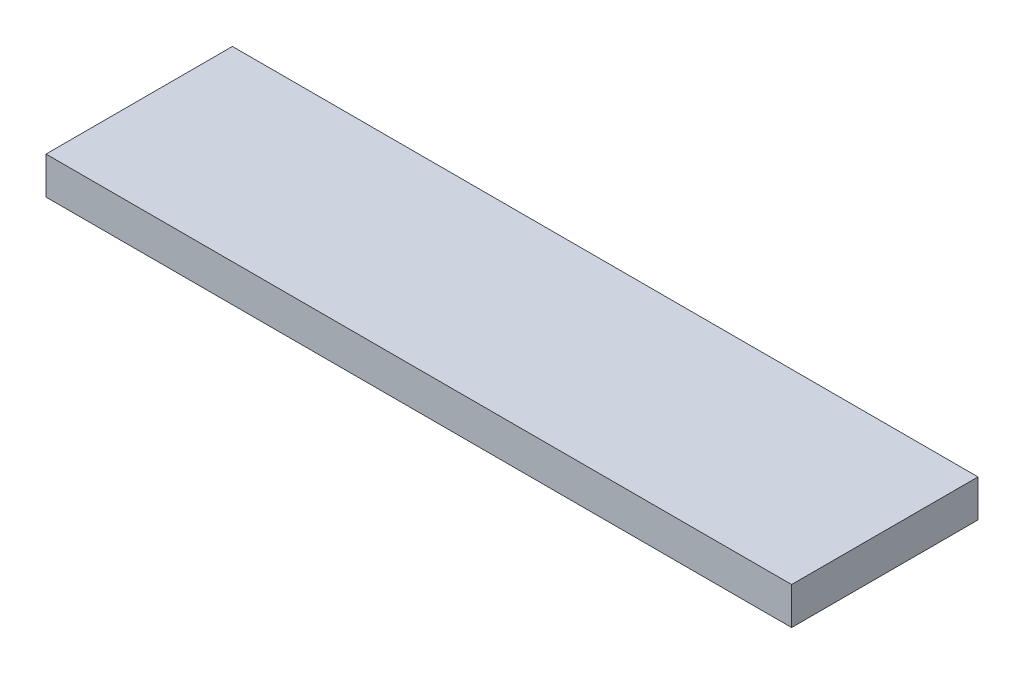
ISO-10303-21;
HEADER;
FILE_DESCRIPTION(('STEP AP214'),'2;1');
FILE_NAME('part.step','',(''),(''),'','','');
FILE_SCHEMA(('AUTOMOTIVE_DESIGN { 1 0 10303 214 1 1 1 1 }'));
ENDSEC;
DATA;
#1=APPLICATION_CONTEXT('core data for automotive mechanical design processes');
#2=APPLICATION_PROTOCOL_DEFINITION('international standard','automotive_design',2000,#1);
#3=PRODUCT_CONTEXT('',#1,'mechanical');
#4=PRODUCT('Part','Part','',(#3));
#5=PRODUCT_RELATED_PRODUCT_CATEGORY('part','',(#4));
#6=PRODUCT_DEFINITION_FORMATION('','',#4);
#7=PRODUCT_DEFINITION_CONTEXT('part definition',#1,'design');
#8=PRODUCT_DEFINITION('design','',#6,#7);
#9=PRODUCT_DEFINITION_SHAPE('','',#8);
#10=(LENGTH_UNIT() NAMED_UNIT(*) SI_UNIT(.MILLI.,.METRE.));
#11=(NAMED_UNIT(*) PLANE_ANGLE_UNIT() SI_UNIT($,.RADIAN.));
#12=(NAMED_UNIT(*) SI_UNIT($,.STERADIAN.) SOLID_ANGLE_UNIT());
#13=UNCERTAINTY_MEASURE_WITH_UNIT(LENGTH_MEASURE(1.E-05),#10,'distance_accuracy_value','');
#14=(GEOMETRIC_REPRESENTATION_CONTEXT(3) GLOBAL_UNCERTAINTY_ASSIGNED_CONTEXT((#13)) GLOBAL_UNIT_ASSIGNED_CONTEXT((#10,
#11,#12)) REPRESENTATION_CONTEXT('',''));
#15=CARTESIAN_POINT('',(0.,0.,0.));
#16=DIRECTION('',(0.,0.,1.));
#17=DIRECTION('',(1.,0.,0.));
#18=AXIS2_PLACEMENT_3D('',#15,#16,#17);
#19=CARTESIAN_POINT('',(100.,5.,0.));
#20=DIRECTION('',(0.,1.,0.));
#21=DIRECTION('',(0.,0.,1.));
#22=AXIS2_PLACEMENT_3D('',#19,#20,#21);
#23=PLANE('',#22);
#24=DIRECTION('',(0.,0.,-1.));
#25=VECTOR('',#24,1.);
#26=CARTESIAN_POINT('',(0.,5.,0.));
#27=LINE('',#26,#25);
#28=CARTESIAN_POINT('',(0.,5.,0.));
#29=VERTEX_POINT('',#28);
#30=CARTESIAN_POINT('',(0.,5.,-25.));
#31=VERTEX_POINT('',#30);
#32=EDGE_CURVE('E115',#29,#31,#27,.T.);
#33=ORIENTED_EDGE('',*,*,#32,.F.);
#34=DIRECTION('',(-1.,0.,0.));
#35=VECTOR('',#34,1.);
#36=CARTESIAN_POINT('',(100.,5.,0.));
#37=LINE('',#36,#35);
#38=CARTESIAN_POINT('',(100.,5.,0.));
#39=VERTEX_POINT('',#38);
#40=EDGE_CURVE('E11',#39,#29,#37,.T.);
#41=ORIENTED_EDGE('',*,*,#40,.F.);
#42=DIRECTION('',(0.,0.,-1.));
#43=VECTOR('',#42,1.);
#44=CARTESIAN_POINT('',(100.,5.,0.));
#45=LINE('',#44,#43);
#46=CARTESIAN_POINT('',(100.,5.,-25.));
#47=VERTEX_POINT('',#46);
#48=EDGE_CURVE('E107',#39,#47,#45,.T.);
#49=ORIENTED_EDGE('',*,*,#48,.T.);
#50=DIRECTION('',(-1.,0.,0.));
#51=VECTOR('',#50,1.);
#52=CARTESIAN_POINT('',(100.,5.,-25.));
#53=LINE('',#52,#51);
#54=EDGE_CURVE('E48',#47,#31,#53,.T.);
#55=ORIENTED_EDGE('',*,*,#54,.T.);
#56=EDGE_LOOP('',(#33,#41,#49,#55));
#57=FACE_BOUND('',#56,.T.);
#58=ADVANCED_FACE('F45',(#57),#23,.T.);
#59=CARTESIAN_POINT('',(100.,0.,0.));
#60=DIRECTION('',(0.,0.,1.));
#61=DIRECTION('',(1.,0.,0.));
#62=AXIS2_PLACEMENT_3D('',#59,#60,#61);
#63=PLANE('',#62);
#64=DIRECTION('',(0.,1.,0.));
#65=VECTOR('',#64,1.);
#66=CARTESIAN_POINT('',(0.,0.,0.));
#67=LINE('',#66,#65);
#68=CARTESIAN_POINT('',(0.,0.,0.));
#69=VERTEX_POINT('',#68);
#70=EDGE_CURVE('E110',#69,#29,#67,.T.);
#71=ORIENTED_EDGE('',*,*,#70,.F.);
#72=DIRECTION('',(-1.,0.,0.));
#73=VECTOR('',#72,1.);
#74=CARTESIAN_POINT('',(100.,0.,0.));
#75=LINE('',#74,#73);
#76=CARTESIAN_POINT('',(100.,0.,0.));
#77=VERTEX_POINT('',#76);
#78=EDGE_CURVE('E55',#77,#69,#75,.T.);
#79=ORIENTED_EDGE('',*,*,#78,.F.);
#80=DIRECTION('',(0.,1.,0.));
#81=VECTOR('',#80,1.);
#82=CARTESIAN_POINT('',(100.,0.,0.));
#83=LINE('',#82,#81);
#84=EDGE_CURVE('E94',#77,#39,#83,.T.);
#85=ORIENTED_EDGE('',*,*,#84,.T.);
#86=ORIENTED_EDGE('',*,*,#40,.T.);
#87=EDGE_LOOP('',(#71,#79,#85,#86));
#88=FACE_BOUND('',#87,.T.);
#89=ADVANCED_FACE('F131',(#88),#63,.T.);
#90=CARTESIAN_POINT('',(100.,0.,0.));
#91=DIRECTION('',(0.,1.,0.));
#92=DIRECTION('',(0.,0.,1.));
#93=AXIS2_PLACEMENT_3D('',#90,#91,#92);
#94=PLANE('',#93);
#95=DIRECTION('',(0.,0.,-1.));
#96=VECTOR('',#95,1.);
#97=CARTESIAN_POINT('',(0.,0.,0.));
#98=LINE('',#97,#96);
#99=CARTESIAN_POINT('',(0.,0.,-25.));
#100=VERTEX_POINT('',#99);
#101=EDGE_CURVE('E100',#69,#100,#98,.T.);
#102=ORIENTED_EDGE('',*,*,#101,.T.);
#103=DIRECTION('',(-1.,0.,0.));
#104=VECTOR('',#103,1.);
#105=CARTESIAN_POINT('',(100.,0.,-25.));
#106=LINE('',#105,#104);
#107=CARTESIAN_POINT('',(100.,0.,-25.));
#108=VERTEX_POINT('',#107);
#109=EDGE_CURVE('E98',#108,#100,#106,.T.);
#110=ORIENTED_EDGE('',*,*,#109,.F.);
#111=DIRECTION('',(0.,0.,-1.));
#112=VECTOR('',#111,1.);
#113=CARTESIAN_POINT('',(100.,0.,0.));
#114=LINE('',#113,#112);
#115=EDGE_CURVE('E91',#77,#108,#114,.T.);
#116=ORIENTED_EDGE('',*,*,#115,.F.);
#117=ORIENTED_EDGE('',*,*,#78,.T.);
#118=EDGE_LOOP('',(#102,#110,#116,#117));
#119=FACE_BOUND('',#118,.T.);
#120=ADVANCED_FACE('F99',(#119),#94,.F.);
#121=CARTESIAN_POINT('',(100.,0.,-25.));
#122=DIRECTION('',(0.,0.,1.));
#123=DIRECTION('',(1.,0.,0.));
#124=AXIS2_PLACEMENT_3D('',#121,#122,#123);
#125=PLANE('',#124);
#126=DIRECTION('',(0.,1.,0.));
#127=VECTOR('',#126,1.);
#128=CARTESIAN_POINT('',(0.,0.,-25.));
#129=LINE('',#128,#127);
#130=EDGE_CURVE('E119',#100,#31,#129,.T.);
#131=ORIENTED_EDGE('',*,*,#130,.T.);
#132=ORIENTED_EDGE('',*,*,#54,.F.);
#133=DIRECTION('',(0.,1.,0.));
#134=VECTOR('',#133,1.);
#135=CARTESIAN_POINT('',(100.,0.,-25.));
#136=LINE('',#135,#134);
#137=EDGE_CURVE('E88',#108,#47,#136,.T.);
#138=ORIENTED_EDGE('',*,*,#137,.F.);
#139=ORIENTED_EDGE('',*,*,#109,.T.);
#140=EDGE_LOOP('',(#131,#132,#138,#139));
#141=FACE_BOUND('',#140,.T.);
#142=ADVANCED_FACE('F105',(#141),#125,.F.);
#143=CARTESIAN_POINT('',(100.,0.,0.));
#144=DIRECTION('',(1.,0.,0.));
#145=DIRECTION('',(0.,0.,-1.));
#146=AXIS2_PLACEMENT_3D('',#143,#144,#145);
#147=PLANE('',#146);
#148=ORIENTED_EDGE('',*,*,#48,.F.);
#149=ORIENTED_EDGE('',*,*,#84,.F.);
#150=ORIENTED_EDGE('',*,*,#115,.T.);
#151=ORIENTED_EDGE('',*,*,#137,.T.);
#152=EDGE_LOOP('',(#148,#149,#150,#151));
#153=FACE_BOUND('',#152,.T.);
#154=ADVANCED_FACE('F93',(#153),#147,.T.);
#155=CARTESIAN_POINT('',(0.,0.,0.));
#156=DIRECTION('',(1.,0.,0.));
#157=DIRECTION('',(0.,0.,-1.));
#158=AXIS2_PLACEMENT_3D('',#155,#156,#157);
#159=PLANE('',#158);
#160=ORIENTED_EDGE('',*,*,#32,.T.);
#161=ORIENTED_EDGE('',*,*,#130,.F.);
#162=ORIENTED_EDGE('',*,*,#101,.F.);
#163=ORIENTED_EDGE('',*,*,#70,.T.);
#164=EDGE_LOOP('',(#160,#161,#162,#163));
#165=FACE_BOUND('',#164,.T.);
#166=ADVANCED_FACE('F130',(#165),#159,.F.);
#167=CLOSED_SHELL('',(#58,#89,#120,#142,#154,#166));
#168=MANIFOLD_SOLID_BREP('B2',#167);
#169=ADVANCED_BREP_SHAPE_REPRESENTATION('',(#18,#168),#14);
#170=SHAPE_DEFINITION_REPRESENTATION(#9,#169);
ENDSEC;
END-ISO-10303-21;
